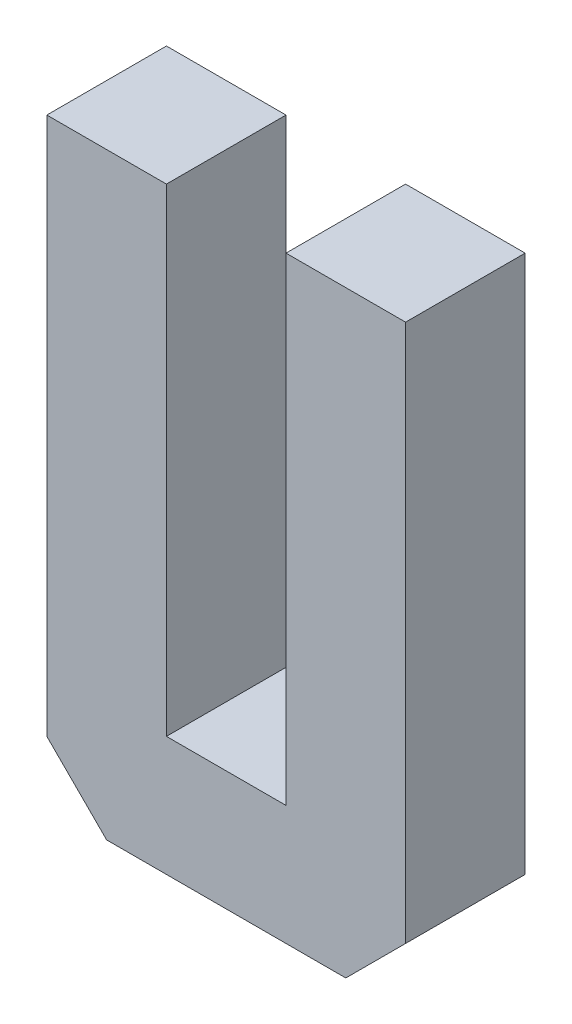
from build123d import *

# Parameters (mm, degrees)
BOSS_EXTRU_1_DEPTH = 10
CHANFREIN1_SIZE    = 5


with BuildPart() as part:
    # Esquisse1 → Boss.-Extru.1 (new body)
    with BuildSketch(Plane.XY):
        Polygon((20, 50), (30, 50), (30, 0), (0, 0), (0, 50), (10, 50), (10, 10), (20, 10), align=None)
    extrude(amount=BOSS_EXTRU_1_DEPTH)

    # Chanfrein1
    chanfrein1_edges = [part.edges().sort_by_distance(p)[0] for p in [
        (30, 0, 5),
        (0, 0, 5),
    ]]
    chamfer(chanfrein1_edges, length=CHANFREIN1_SIZE)


solid = part.part
